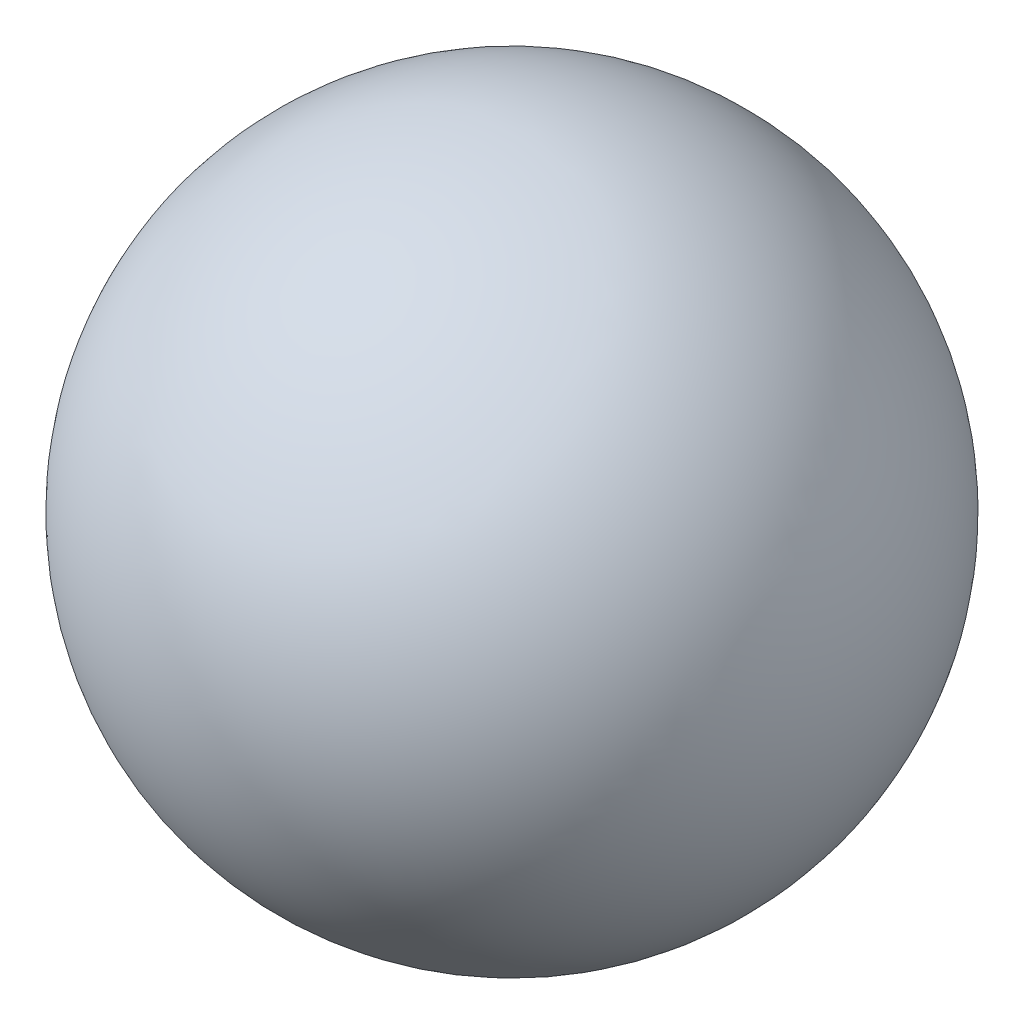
from build123d import *


with BuildPart() as part:
    # Esquisse1 → R_volution1 (revolve)
    with BuildSketch(Plane.XY):
        with BuildLine():
            Line((-3.97, 0), (3.97, 0))
            ThreePointArc((3.97, 0), (0, 3.97), (-3.97, 0))
        make_face()
    revolve(axis=Axis((-12.750911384, 0, 0), (1, 0, 0)))


solid = part.part
